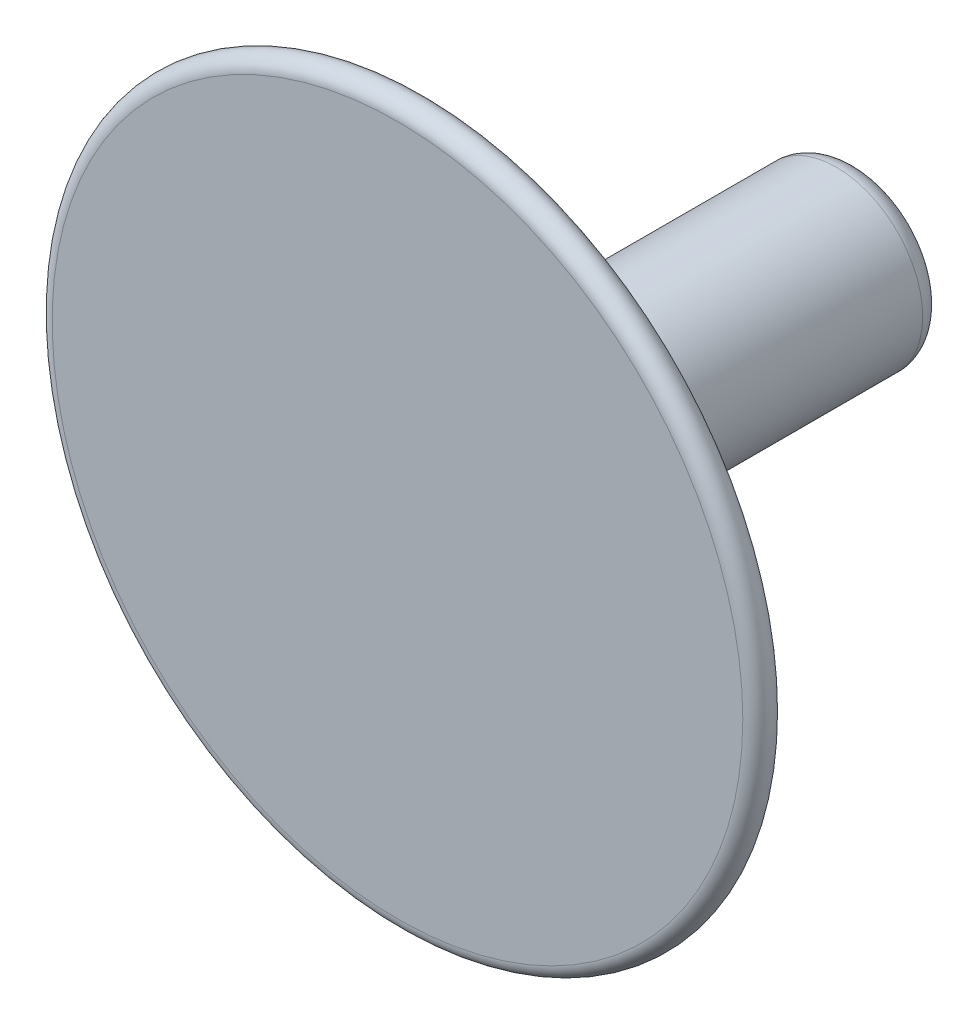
ISO-10303-21;
HEADER;
FILE_DESCRIPTION(('STEP AP214'),'2;1');
FILE_NAME('part.step','',(''),(''),'','','');
FILE_SCHEMA(('AUTOMOTIVE_DESIGN { 1 0 10303 214 1 1 1 1 }'));
ENDSEC;
DATA;
#1=APPLICATION_CONTEXT('core data for automotive mechanical design processes');
#2=APPLICATION_PROTOCOL_DEFINITION('international standard','automotive_design',2000,#1);
#3=PRODUCT_CONTEXT('',#1,'mechanical');
#4=PRODUCT('Part','Part','',(#3));
#5=PRODUCT_RELATED_PRODUCT_CATEGORY('part','',(#4));
#6=PRODUCT_DEFINITION_FORMATION('','',#4);
#7=PRODUCT_DEFINITION_CONTEXT('part definition',#1,'design');
#8=PRODUCT_DEFINITION('design','',#6,#7);
#9=PRODUCT_DEFINITION_SHAPE('','',#8);
#10=(LENGTH_UNIT() NAMED_UNIT(*) SI_UNIT(.MILLI.,.METRE.));
#11=(NAMED_UNIT(*) PLANE_ANGLE_UNIT() SI_UNIT($,.RADIAN.));
#12=(NAMED_UNIT(*) SI_UNIT($,.STERADIAN.) SOLID_ANGLE_UNIT());
#13=UNCERTAINTY_MEASURE_WITH_UNIT(LENGTH_MEASURE(1.E-05),#10,'distance_accuracy_value','');
#14=(GEOMETRIC_REPRESENTATION_CONTEXT(3) GLOBAL_UNCERTAINTY_ASSIGNED_CONTEXT((#13)) GLOBAL_UNIT_ASSIGNED_CONTEXT((#10,
#11,#12)) REPRESENTATION_CONTEXT('',''));
#15=CARTESIAN_POINT('',(0.,0.,0.));
#16=DIRECTION('',(0.,0.,1.));
#17=DIRECTION('',(1.,0.,0.));
#18=AXIS2_PLACEMENT_3D('',#15,#16,#17);
#19=CARTESIAN_POINT('',(-6.,0.,0.1));
#20=DIRECTION('',(0.,0.,1.));
#21=DIRECTION('',(1.,0.,0.));
#22=AXIS2_PLACEMENT_3D('',#19,#20,#21);
#23=TOROIDAL_SURFACE('',#22,2.4,0.0999999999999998);
#24=CARTESIAN_POINT('',(-6.,0.,0.2));
#25=DIRECTION('',(0.,0.,1.));
#26=DIRECTION('',(1.,0.,0.));
#27=AXIS2_PLACEMENT_3D('',#24,#25,#26);
#28=CIRCLE('',#27,2.4);
#29=CARTESIAN_POINT('',(-3.6,0.,0.2));
#30=VERTEX_POINT('',#29);
#31=EDGE_CURVE('E45',#30,#30,#28,.T.);
#32=ORIENTED_EDGE('',*,*,#31,.F.);
#33=EDGE_LOOP('',(#32));
#34=FACE_BOUND('',#33,.T.);
#35=CARTESIAN_POINT('',(-6.,0.,0.));
#36=DIRECTION('',(0.,0.,1.));
#37=DIRECTION('',(1.,0.,0.));
#38=AXIS2_PLACEMENT_3D('',#35,#36,#37);
#39=CIRCLE('',#38,2.4);
#40=CARTESIAN_POINT('',(-3.6,0.,0.));
#41=VERTEX_POINT('',#40);
#42=EDGE_CURVE('E41',#41,#41,#39,.F.);
#43=ORIENTED_EDGE('',*,*,#42,.F.);
#44=EDGE_LOOP('',(#43));
#45=FACE_BOUND('',#44,.T.);
#46=ADVANCED_FACE('F31',(#34,#45),#23,.T.);
#47=CARTESIAN_POINT('',(-6.,0.,0.));
#48=DIRECTION('',(0.,0.,1.));
#49=DIRECTION('',(1.,0.,0.));
#50=AXIS2_PLACEMENT_3D('',#47,#48,#49);
#51=PLANE('',#50);
#52=ORIENTED_EDGE('',*,*,#42,.T.);
#53=EDGE_LOOP('',(#52));
#54=FACE_BOUND('',#53,.T.);
#55=CARTESIAN_POINT('',(-6.,0.,0.));
#56=DIRECTION('',(0.,0.,1.));
#57=DIRECTION('',(1.,0.,0.));
#58=AXIS2_PLACEMENT_3D('',#55,#56,#57);
#59=CIRCLE('',#58,0.6);
#60=CARTESIAN_POINT('',(-5.4,0.,0.));
#61=VERTEX_POINT('',#60);
#62=EDGE_CURVE('E50',#61,#61,#59,.F.);
#63=ORIENTED_EDGE('',*,*,#62,.F.);
#64=EDGE_LOOP('',(#63));
#65=FACE_BOUND('',#64,.T.);
#66=ADVANCED_FACE('F56',(#54,#65),#51,.F.);
#67=CARTESIAN_POINT('',(-6.,0.,0.2));
#68=DIRECTION('',(0.,0.,1.));
#69=DIRECTION('',(1.,0.,0.));
#70=AXIS2_PLACEMENT_3D('',#67,#68,#69);
#71=PLANE('',#70);
#72=ORIENTED_EDGE('',*,*,#31,.T.);
#73=EDGE_LOOP('',(#72));
#74=FACE_BOUND('',#73,.T.);
#75=ADVANCED_FACE('F58',(#74),#71,.T.);
#76=CARTESIAN_POINT('',(-6.,0.,-4.69705627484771));
#77=DIRECTION('',(0.,0.,1.));
#78=DIRECTION('',(1.,0.,0.));
#79=AXIS2_PLACEMENT_3D('',#76,#77,#78);
#80=CYLINDRICAL_SURFACE('',#79,0.6);
#81=CARTESIAN_POINT('',(-6.,0.,-2.85));
#82=DIRECTION('',(0.,0.,-1.));
#83=DIRECTION('',(-1.,0.,0.));
#84=AXIS2_PLACEMENT_3D('',#81,#82,#83);
#85=CIRCLE('',#84,0.6);
#86=CARTESIAN_POINT('',(-6.6,0.,-2.85));
#87=VERTEX_POINT('',#86);
#88=EDGE_CURVE('E10',#87,#87,#85,.F.);
#89=ORIENTED_EDGE('',*,*,#88,.T.);
#90=EDGE_LOOP('',(#89));
#91=FACE_BOUND('',#90,.T.);
#92=ORIENTED_EDGE('',*,*,#62,.T.);
#93=EDGE_LOOP('',(#92));
#94=FACE_BOUND('',#93,.T.);
#95=ADVANCED_FACE('F54',(#91,#94),#80,.T.);
#96=CARTESIAN_POINT('',(-11.35,4.,-3.));
#97=DIRECTION('',(0.,0.,-1.));
#98=DIRECTION('',(-1.,0.,0.));
#99=AXIS2_PLACEMENT_3D('',#96,#97,#98);
#100=PLANE('',#99);
#101=CARTESIAN_POINT('',(-6.,0.,-3.));
#102=DIRECTION('',(0.,0.,-1.));
#103=DIRECTION('',(-1.,0.,0.));
#104=AXIS2_PLACEMENT_3D('',#101,#102,#103);
#105=CIRCLE('',#104,0.45);
#106=CARTESIAN_POINT('',(-6.45,0.,-3.));
#107=VERTEX_POINT('',#106);
#108=EDGE_CURVE('E37',#107,#107,#105,.T.);
#109=ORIENTED_EDGE('',*,*,#108,.T.);
#110=EDGE_LOOP('',(#109));
#111=FACE_BOUND('',#110,.T.);
#112=ADVANCED_FACE('F68',(#111),#100,.T.);
#113=CARTESIAN_POINT('',(-6.,0.,-2.85));
#114=DIRECTION('',(0.,0.,-1.));
#115=DIRECTION('',(-1.,0.,0.));
#116=AXIS2_PLACEMENT_3D('',#113,#114,#115);
#117=TOROIDAL_SURFACE('',#116,0.45,0.15);
#118=ORIENTED_EDGE('',*,*,#88,.F.);
#119=EDGE_LOOP('',(#118));
#120=FACE_BOUND('',#119,.T.);
#121=ORIENTED_EDGE('',*,*,#108,.F.);
#122=EDGE_LOOP('',(#121));
#123=FACE_BOUND('',#122,.T.);
#124=ADVANCED_FACE('F71',(#120,#123),#117,.T.);
#125=CLOSED_SHELL('',(#46,#66,#75,#95,#112,#124));
#126=MANIFOLD_SOLID_BREP('B2',#125);
#127=ADVANCED_BREP_SHAPE_REPRESENTATION('',(#18,#126),#14);
#128=SHAPE_DEFINITION_REPRESENTATION(#9,#127);
ENDSEC;
END-ISO-10303-21;
